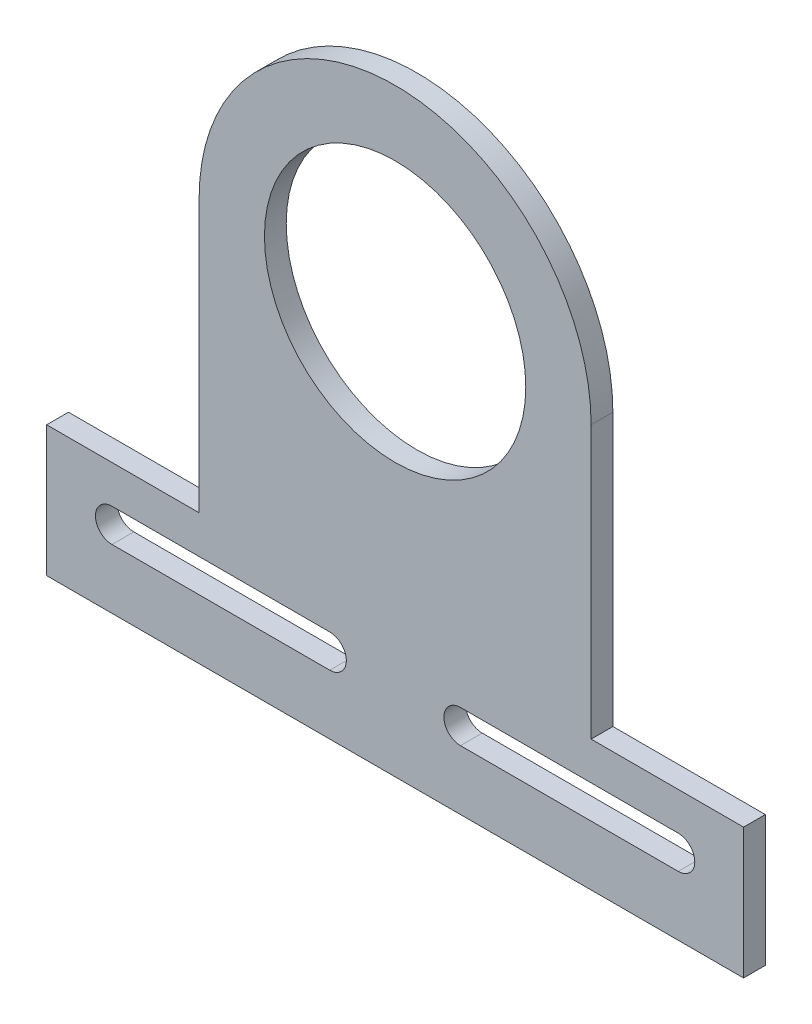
ISO-10303-21;
HEADER;
FILE_DESCRIPTION(('STEP AP214'),'2;1');
FILE_NAME('part.step','',(''),(''),'','','');
FILE_SCHEMA(('AUTOMOTIVE_DESIGN { 1 0 10303 214 1 1 1 1 }'));
ENDSEC;
DATA;
#1=APPLICATION_CONTEXT('core data for automotive mechanical design processes');
#2=APPLICATION_PROTOCOL_DEFINITION('international standard','automotive_design',2000,#1);
#3=PRODUCT_CONTEXT('',#1,'mechanical');
#4=PRODUCT('Part','Part','',(#3));
#5=PRODUCT_RELATED_PRODUCT_CATEGORY('part','',(#4));
#6=PRODUCT_DEFINITION_FORMATION('','',#4);
#7=PRODUCT_DEFINITION_CONTEXT('part definition',#1,'design');
#8=PRODUCT_DEFINITION('design','',#6,#7);
#9=PRODUCT_DEFINITION_SHAPE('','',#8);
#10=(LENGTH_UNIT() NAMED_UNIT(*) SI_UNIT(.MILLI.,.METRE.));
#11=(NAMED_UNIT(*) PLANE_ANGLE_UNIT() SI_UNIT($,.RADIAN.));
#12=(NAMED_UNIT(*) SI_UNIT($,.STERADIAN.) SOLID_ANGLE_UNIT());
#13=UNCERTAINTY_MEASURE_WITH_UNIT(LENGTH_MEASURE(1.E-05),#10,'distance_accuracy_value','');
#14=(GEOMETRIC_REPRESENTATION_CONTEXT(3) GLOBAL_UNCERTAINTY_ASSIGNED_CONTEXT((#13)) GLOBAL_UNIT_ASSIGNED_CONTEXT((#10,
#11,#12)) REPRESENTATION_CONTEXT('',''));
#15=CARTESIAN_POINT('',(0.,0.,0.));
#16=DIRECTION('',(0.,0.,1.));
#17=DIRECTION('',(1.,0.,0.));
#18=AXIS2_PLACEMENT_3D('',#15,#16,#17);
#19=CARTESIAN_POINT('',(0.,0.,6.35));
#20=DIRECTION('',(0.,0.,-1.));
#21=DIRECTION('',(-1.,0.,0.));
#22=AXIS2_PLACEMENT_3D('',#19,#20,#21);
#23=PLANE('',#22);
#24=CARTESIAN_POINT('',(0.,0.,6.35));
#25=DIRECTION('',(0.,0.,1.));
#26=DIRECTION('',(-1.,0.,0.));
#27=AXIS2_PLACEMENT_3D('',#24,#25,#26);
#28=CIRCLE('',#27,57.15);
#29=CARTESIAN_POINT('',(57.15,0.,6.35));
#30=VERTEX_POINT('',#29);
#31=CARTESIAN_POINT('',(-57.15,0.,6.35));
#32=VERTEX_POINT('',#31);
#33=EDGE_CURVE('E243',#30,#32,#28,.T.);
#34=ORIENTED_EDGE('',*,*,#33,.T.);
#35=DIRECTION('',(0.,-1.,0.));
#36=VECTOR('',#35,1.);
#37=CARTESIAN_POINT('',(-57.15,-79.375,6.35));
#38=LINE('',#37,#36);
#39=CARTESIAN_POINT('',(-57.15,-79.375,6.35));
#40=VERTEX_POINT('',#39);
#41=EDGE_CURVE('E246',#32,#40,#38,.T.);
#42=ORIENTED_EDGE('',*,*,#41,.T.);
#43=DIRECTION('',(-1.,0.,0.));
#44=VECTOR('',#43,1.);
#45=CARTESIAN_POINT('',(-101.6,-79.375,6.35));
#46=LINE('',#45,#44);
#47=CARTESIAN_POINT('',(-101.6,-79.375,6.35));
#48=VERTEX_POINT('',#47);
#49=EDGE_CURVE('E248',#40,#48,#46,.T.);
#50=ORIENTED_EDGE('',*,*,#49,.T.);
#51=DIRECTION('',(0.,-1.,0.));
#52=VECTOR('',#51,1.);
#53=CARTESIAN_POINT('',(-101.6,-117.475,6.35));
#54=LINE('',#53,#52);
#55=CARTESIAN_POINT('',(-101.6,-117.475,6.35));
#56=VERTEX_POINT('',#55);
#57=EDGE_CURVE('E250',#48,#56,#54,.T.);
#58=ORIENTED_EDGE('',*,*,#57,.T.);
#59=DIRECTION('',(1.,0.,0.));
#60=VECTOR('',#59,1.);
#61=CARTESIAN_POINT('',(101.6,-117.475,6.35));
#62=LINE('',#61,#60);
#63=CARTESIAN_POINT('',(101.6,-117.475,6.35));
#64=VERTEX_POINT('',#63);
#65=EDGE_CURVE('E252',#56,#64,#62,.T.);
#66=ORIENTED_EDGE('',*,*,#65,.T.);
#67=DIRECTION('',(0.,1.,0.));
#68=VECTOR('',#67,1.);
#69=CARTESIAN_POINT('',(101.6,-79.375,6.35));
#70=LINE('',#69,#68);
#71=CARTESIAN_POINT('',(101.6,-79.375,6.35));
#72=VERTEX_POINT('',#71);
#73=EDGE_CURVE('E254',#64,#72,#70,.T.);
#74=ORIENTED_EDGE('',*,*,#73,.T.);
#75=DIRECTION('',(-1.,0.,0.));
#76=VECTOR('',#75,1.);
#77=CARTESIAN_POINT('',(57.15,-79.375,6.35));
#78=LINE('',#77,#76);
#79=CARTESIAN_POINT('',(57.15,-79.375,6.35));
#80=VERTEX_POINT('',#79);
#81=EDGE_CURVE('E256',#72,#80,#78,.T.);
#82=ORIENTED_EDGE('',*,*,#81,.T.);
#83=DIRECTION('',(0.,1.,0.));
#84=VECTOR('',#83,1.);
#85=CARTESIAN_POINT('',(57.15,0.,6.35));
#86=LINE('',#85,#84);
#87=EDGE_CURVE('E258',#80,#30,#86,.T.);
#88=ORIENTED_EDGE('',*,*,#87,.T.);
#89=EDGE_LOOP('',(#34,#42,#50,#58,#66,#74,#82,#88));
#90=FACE_BOUND('',#89,.T.);
#91=CARTESIAN_POINT('',(0.,0.,6.35));
#92=DIRECTION('',(0.,0.,1.));
#93=DIRECTION('',(1.,0.,0.));
#94=AXIS2_PLACEMENT_3D('',#91,#92,#93);
#95=CIRCLE('',#94,38.1);
#96=CARTESIAN_POINT('',(38.1,0.,6.35));
#97=VERTEX_POINT('',#96);
#98=EDGE_CURVE('E214',#97,#97,#95,.T.);
#99=ORIENTED_EDGE('',*,*,#98,.F.);
#100=EDGE_LOOP('',(#99));
#101=FACE_BOUND('',#100,.T.);
#102=DIRECTION('',(1.,0.,0.));
#103=VECTOR('',#102,1.);
#104=CARTESIAN_POINT('',(-82.55,-100.076,6.35));
#105=LINE('',#104,#103);
#106=CARTESIAN_POINT('',(-82.55,-100.076,6.35));
#107=VERTEX_POINT('',#106);
#108=CARTESIAN_POINT('',(-19.05,-100.076,6.35));
#109=VERTEX_POINT('',#108);
#110=EDGE_CURVE('E190',#107,#109,#105,.T.);
#111=ORIENTED_EDGE('',*,*,#110,.F.);
#112=CARTESIAN_POINT('',(-82.55,-95.25,6.35));
#113=DIRECTION('',(0.,0.,1.));
#114=DIRECTION('',(1.,0.,0.));
#115=AXIS2_PLACEMENT_3D('',#112,#113,#114);
#116=CIRCLE('',#115,4.826);
#117=CARTESIAN_POINT('',(-82.55,-90.424,6.35));
#118=VERTEX_POINT('',#117);
#119=EDGE_CURVE('E186',#118,#107,#116,.T.);
#120=ORIENTED_EDGE('',*,*,#119,.F.);
#121=DIRECTION('',(-1.,0.,0.));
#122=VECTOR('',#121,1.);
#123=CARTESIAN_POINT('',(-19.05,-90.424,6.35));
#124=LINE('',#123,#122);
#125=CARTESIAN_POINT('',(-19.05,-90.424,6.35));
#126=VERTEX_POINT('',#125);
#127=EDGE_CURVE('E196',#126,#118,#124,.T.);
#128=ORIENTED_EDGE('',*,*,#127,.F.);
#129=CARTESIAN_POINT('',(-19.05,-95.25,6.35));
#130=DIRECTION('',(0.,0.,1.));
#131=DIRECTION('',(1.,0.,0.));
#132=AXIS2_PLACEMENT_3D('',#129,#130,#131);
#133=CIRCLE('',#132,4.826);
#134=EDGE_CURVE('E193',#109,#126,#133,.T.);
#135=ORIENTED_EDGE('',*,*,#134,.F.);
#136=EDGE_LOOP('',(#111,#120,#128,#135));
#137=FACE_BOUND('',#136,.T.);
#138=CARTESIAN_POINT('',(82.55,-95.25,6.35));
#139=DIRECTION('',(0.,0.,-1.));
#140=DIRECTION('',(-1.,0.,0.));
#141=AXIS2_PLACEMENT_3D('',#138,#139,#140);
#142=CIRCLE('',#141,4.826);
#143=CARTESIAN_POINT('',(82.55,-90.424,6.35));
#144=VERTEX_POINT('',#143);
#145=CARTESIAN_POINT('',(82.55,-100.076,6.35));
#146=VERTEX_POINT('',#145);
#147=EDGE_CURVE('E57',#144,#146,#142,.T.);
#148=ORIENTED_EDGE('',*,*,#147,.T.);
#149=DIRECTION('',(-1.,0.,0.));
#150=VECTOR('',#149,1.);
#151=CARTESIAN_POINT('',(82.55,-100.076,6.35));
#152=LINE('',#151,#150);
#153=CARTESIAN_POINT('',(19.05,-100.076,6.35));
#154=VERTEX_POINT('',#153);
#155=EDGE_CURVE('E172',#146,#154,#152,.T.);
#156=ORIENTED_EDGE('',*,*,#155,.T.);
#157=CARTESIAN_POINT('',(19.05,-95.25,6.35));
#158=DIRECTION('',(0.,0.,-1.));
#159=DIRECTION('',(-1.,0.,0.));
#160=AXIS2_PLACEMENT_3D('',#157,#158,#159);
#161=CIRCLE('',#160,4.826);
#162=CARTESIAN_POINT('',(19.05,-90.424,6.35));
#163=VERTEX_POINT('',#162);
#164=EDGE_CURVE('E159',#154,#163,#161,.T.);
#165=ORIENTED_EDGE('',*,*,#164,.T.);
#166=DIRECTION('',(1.,0.,0.));
#167=VECTOR('',#166,1.);
#168=CARTESIAN_POINT('',(19.05,-90.424,6.35));
#169=LINE('',#168,#167);
#170=EDGE_CURVE('E168',#163,#144,#169,.T.);
#171=ORIENTED_EDGE('',*,*,#170,.T.);
#172=EDGE_LOOP('',(#148,#156,#165,#171));
#173=FACE_BOUND('',#172,.T.);
#174=ADVANCED_FACE('F42',(#90,#101,#137,#173),#23,.F.);
#175=CARTESIAN_POINT('',(0.,0.,0.));
#176=DIRECTION('',(0.,0.,-1.));
#177=DIRECTION('',(-1.,0.,0.));
#178=AXIS2_PLACEMENT_3D('',#175,#176,#177);
#179=PLANE('',#178);
#180=CARTESIAN_POINT('',(0.,0.,0.));
#181=DIRECTION('',(0.,0.,1.));
#182=DIRECTION('',(-1.,0.,0.));
#183=AXIS2_PLACEMENT_3D('',#180,#181,#182);
#184=CIRCLE('',#183,57.15);
#185=CARTESIAN_POINT('',(57.15,0.,0.));
#186=VERTEX_POINT('',#185);
#187=CARTESIAN_POINT('',(-57.15,0.,0.));
#188=VERTEX_POINT('',#187);
#189=EDGE_CURVE('E226',#186,#188,#184,.T.);
#190=ORIENTED_EDGE('',*,*,#189,.F.);
#191=DIRECTION('',(0.,1.,0.));
#192=VECTOR('',#191,1.);
#193=CARTESIAN_POINT('',(57.15,0.,0.));
#194=LINE('',#193,#192);
#195=CARTESIAN_POINT('',(57.15,-79.375,0.));
#196=VERTEX_POINT('',#195);
#197=EDGE_CURVE('E241',#196,#186,#194,.T.);
#198=ORIENTED_EDGE('',*,*,#197,.F.);
#199=DIRECTION('',(-1.,0.,0.));
#200=VECTOR('',#199,1.);
#201=CARTESIAN_POINT('',(57.15,-79.375,0.));
#202=LINE('',#201,#200);
#203=CARTESIAN_POINT('',(101.6,-79.375,0.));
#204=VERTEX_POINT('',#203);
#205=EDGE_CURVE('E239',#204,#196,#202,.T.);
#206=ORIENTED_EDGE('',*,*,#205,.F.);
#207=DIRECTION('',(0.,1.,0.));
#208=VECTOR('',#207,1.);
#209=CARTESIAN_POINT('',(101.6,-79.375,0.));
#210=LINE('',#209,#208);
#211=CARTESIAN_POINT('',(101.6,-117.475,0.));
#212=VERTEX_POINT('',#211);
#213=EDGE_CURVE('E237',#212,#204,#210,.T.);
#214=ORIENTED_EDGE('',*,*,#213,.F.);
#215=DIRECTION('',(1.,0.,0.));
#216=VECTOR('',#215,1.);
#217=CARTESIAN_POINT('',(101.6,-117.475,0.));
#218=LINE('',#217,#216);
#219=CARTESIAN_POINT('',(-101.6,-117.475,0.));
#220=VERTEX_POINT('',#219);
#221=EDGE_CURVE('E235',#220,#212,#218,.T.);
#222=ORIENTED_EDGE('',*,*,#221,.F.);
#223=DIRECTION('',(0.,-1.,0.));
#224=VECTOR('',#223,1.);
#225=CARTESIAN_POINT('',(-101.6,-117.475,0.));
#226=LINE('',#225,#224);
#227=CARTESIAN_POINT('',(-101.6,-79.375,0.));
#228=VERTEX_POINT('',#227);
#229=EDGE_CURVE('E233',#228,#220,#226,.T.);
#230=ORIENTED_EDGE('',*,*,#229,.F.);
#231=DIRECTION('',(-1.,0.,0.));
#232=VECTOR('',#231,1.);
#233=CARTESIAN_POINT('',(-101.6,-79.375,0.));
#234=LINE('',#233,#232);
#235=CARTESIAN_POINT('',(-57.15,-79.375,0.));
#236=VERTEX_POINT('',#235);
#237=EDGE_CURVE('E231',#236,#228,#234,.T.);
#238=ORIENTED_EDGE('',*,*,#237,.F.);
#239=DIRECTION('',(0.,-1.,0.));
#240=VECTOR('',#239,1.);
#241=CARTESIAN_POINT('',(-57.15,-79.375,0.));
#242=LINE('',#241,#240);
#243=EDGE_CURVE('E229',#188,#236,#242,.T.);
#244=ORIENTED_EDGE('',*,*,#243,.F.);
#245=EDGE_LOOP('',(#190,#198,#206,#214,#222,#230,#238,#244));
#246=FACE_BOUND('',#245,.T.);
#247=CARTESIAN_POINT('',(0.,0.,0.));
#248=DIRECTION('',(0.,0.,1.));
#249=DIRECTION('',(1.,0.,0.));
#250=AXIS2_PLACEMENT_3D('',#247,#248,#249);
#251=CIRCLE('',#250,38.1);
#252=CARTESIAN_POINT('',(38.1,0.,0.));
#253=VERTEX_POINT('',#252);
#254=EDGE_CURVE('E223',#253,#253,#251,.T.);
#255=ORIENTED_EDGE('',*,*,#254,.T.);
#256=EDGE_LOOP('',(#255));
#257=FACE_BOUND('',#256,.T.);
#258=CARTESIAN_POINT('',(-82.55,-95.25,0.));
#259=DIRECTION('',(0.,0.,1.));
#260=DIRECTION('',(1.,0.,0.));
#261=AXIS2_PLACEMENT_3D('',#258,#259,#260);
#262=CIRCLE('',#261,4.826);
#263=CARTESIAN_POINT('',(-82.55,-90.424,0.));
#264=VERTEX_POINT('',#263);
#265=CARTESIAN_POINT('',(-82.55,-100.076,0.));
#266=VERTEX_POINT('',#265);
#267=EDGE_CURVE('E199',#264,#266,#262,.T.);
#268=ORIENTED_EDGE('',*,*,#267,.T.);
#269=DIRECTION('',(1.,0.,0.));
#270=VECTOR('',#269,1.);
#271=CARTESIAN_POINT('',(-82.55,-100.076,0.));
#272=LINE('',#271,#270);
#273=CARTESIAN_POINT('',(-19.05,-100.076,0.));
#274=VERTEX_POINT('',#273);
#275=EDGE_CURVE('E202',#266,#274,#272,.T.);
#276=ORIENTED_EDGE('',*,*,#275,.T.);
#277=CARTESIAN_POINT('',(-19.05,-95.25,0.));
#278=DIRECTION('',(0.,0.,1.));
#279=DIRECTION('',(1.,0.,0.));
#280=AXIS2_PLACEMENT_3D('',#277,#278,#279);
#281=CIRCLE('',#280,4.826);
#282=CARTESIAN_POINT('',(-19.05,-90.424,0.));
#283=VERTEX_POINT('',#282);
#284=EDGE_CURVE('E205',#274,#283,#281,.T.);
#285=ORIENTED_EDGE('',*,*,#284,.T.);
#286=DIRECTION('',(-1.,0.,0.));
#287=VECTOR('',#286,1.);
#288=CARTESIAN_POINT('',(-19.05,-90.424,0.));
#289=LINE('',#288,#287);
#290=EDGE_CURVE('E208',#283,#264,#289,.T.);
#291=ORIENTED_EDGE('',*,*,#290,.T.);
#292=EDGE_LOOP('',(#268,#276,#285,#291));
#293=FACE_BOUND('',#292,.T.);
#294=DIRECTION('',(-1.,0.,0.));
#295=VECTOR('',#294,1.);
#296=CARTESIAN_POINT('',(82.55,-100.076,0.));
#297=LINE('',#296,#295);
#298=CARTESIAN_POINT('',(82.55,-100.076,0.));
#299=VERTEX_POINT('',#298);
#300=CARTESIAN_POINT('',(19.05,-100.076,0.));
#301=VERTEX_POINT('',#300);
#302=EDGE_CURVE('E182',#299,#301,#297,.T.);
#303=ORIENTED_EDGE('',*,*,#302,.F.);
#304=CARTESIAN_POINT('',(82.55,-95.25,0.));
#305=DIRECTION('',(0.,0.,-1.));
#306=DIRECTION('',(-1.,0.,0.));
#307=AXIS2_PLACEMENT_3D('',#304,#305,#306);
#308=CIRCLE('',#307,4.826);
#309=CARTESIAN_POINT('',(82.55,-90.424,0.));
#310=VERTEX_POINT('',#309);
#311=EDGE_CURVE('E174',#310,#299,#308,.T.);
#312=ORIENTED_EDGE('',*,*,#311,.F.);
#313=DIRECTION('',(1.,0.,0.));
#314=VECTOR('',#313,1.);
#315=CARTESIAN_POINT('',(19.05,-90.424,0.));
#316=LINE('',#315,#314);
#317=CARTESIAN_POINT('',(19.05,-90.424,0.));
#318=VERTEX_POINT('',#317);
#319=EDGE_CURVE('E179',#318,#310,#316,.T.);
#320=ORIENTED_EDGE('',*,*,#319,.F.);
#321=CARTESIAN_POINT('',(19.05,-95.25,0.));
#322=DIRECTION('',(0.,0.,-1.));
#323=DIRECTION('',(-1.,0.,0.));
#324=AXIS2_PLACEMENT_3D('',#321,#322,#323);
#325=CIRCLE('',#324,4.826);
#326=EDGE_CURVE('E162',#301,#318,#325,.T.);
#327=ORIENTED_EDGE('',*,*,#326,.F.);
#328=EDGE_LOOP('',(#303,#312,#320,#327));
#329=FACE_BOUND('',#328,.T.);
#330=ADVANCED_FACE('F288',(#246,#257,#293,#329),#179,.T.);
#331=CARTESIAN_POINT('',(0.,0.,6.35));
#332=DIRECTION('',(0.,0.,-1.));
#333=DIRECTION('',(-1.,0.,0.));
#334=AXIS2_PLACEMENT_3D('',#331,#332,#333);
#335=CYLINDRICAL_SURFACE('',#334,57.15);
#336=ORIENTED_EDGE('',*,*,#189,.T.);
#337=DIRECTION('',(0.,0.,-1.));
#338=VECTOR('',#337,1.);
#339=CARTESIAN_POINT('',(-57.15,0.,6.35));
#340=LINE('',#339,#338);
#341=EDGE_CURVE('E11',#32,#188,#340,.T.);
#342=ORIENTED_EDGE('',*,*,#341,.F.);
#343=ORIENTED_EDGE('',*,*,#33,.F.);
#344=DIRECTION('',(0.,0.,-1.));
#345=VECTOR('',#344,1.);
#346=CARTESIAN_POINT('',(57.15,0.,6.35));
#347=LINE('',#346,#345);
#348=EDGE_CURVE('E260',#30,#186,#347,.T.);
#349=ORIENTED_EDGE('',*,*,#348,.T.);
#350=EDGE_LOOP('',(#336,#342,#343,#349));
#351=FACE_BOUND('',#350,.T.);
#352=ADVANCED_FACE('F44',(#351),#335,.T.);
#353=CARTESIAN_POINT('',(-57.15,-79.375,6.35));
#354=DIRECTION('',(1.,0.,0.));
#355=DIRECTION('',(0.,0.,-1.));
#356=AXIS2_PLACEMENT_3D('',#353,#354,#355);
#357=PLANE('',#356);
#358=ORIENTED_EDGE('',*,*,#243,.T.);
#359=DIRECTION('',(0.,0.,-1.));
#360=VECTOR('',#359,1.);
#361=CARTESIAN_POINT('',(-57.15,-79.375,6.35));
#362=LINE('',#361,#360);
#363=EDGE_CURVE('E50',#40,#236,#362,.T.);
#364=ORIENTED_EDGE('',*,*,#363,.F.);
#365=ORIENTED_EDGE('',*,*,#41,.F.);
#366=ORIENTED_EDGE('',*,*,#341,.T.);
#367=EDGE_LOOP('',(#358,#364,#365,#366));
#368=FACE_BOUND('',#367,.T.);
#369=ADVANCED_FACE('F306',(#368),#357,.F.);
#370=CARTESIAN_POINT('',(-101.6,-79.375,6.35));
#371=DIRECTION('',(0.,-1.,0.));
#372=DIRECTION('',(0.,0.,-1.));
#373=AXIS2_PLACEMENT_3D('',#370,#371,#372);
#374=PLANE('',#373);
#375=ORIENTED_EDGE('',*,*,#237,.T.);
#376=DIRECTION('',(0.,0.,-1.));
#377=VECTOR('',#376,1.);
#378=CARTESIAN_POINT('',(-101.6,-79.375,6.35));
#379=LINE('',#378,#377);
#380=EDGE_CURVE('E275',#48,#228,#379,.T.);
#381=ORIENTED_EDGE('',*,*,#380,.F.);
#382=ORIENTED_EDGE('',*,*,#49,.F.);
#383=ORIENTED_EDGE('',*,*,#363,.T.);
#384=EDGE_LOOP('',(#375,#381,#382,#383));
#385=FACE_BOUND('',#384,.T.);
#386=ADVANCED_FACE('F282',(#385),#374,.F.);
#387=CARTESIAN_POINT('',(-101.6,-117.475,6.35));
#388=DIRECTION('',(1.,0.,0.));
#389=DIRECTION('',(0.,0.,-1.));
#390=AXIS2_PLACEMENT_3D('',#387,#388,#389);
#391=PLANE('',#390);
#392=ORIENTED_EDGE('',*,*,#229,.T.);
#393=DIRECTION('',(0.,0.,-1.));
#394=VECTOR('',#393,1.);
#395=CARTESIAN_POINT('',(-101.6,-117.475,6.35));
#396=LINE('',#395,#394);
#397=EDGE_CURVE('E272',#56,#220,#396,.T.);
#398=ORIENTED_EDGE('',*,*,#397,.F.);
#399=ORIENTED_EDGE('',*,*,#57,.F.);
#400=ORIENTED_EDGE('',*,*,#380,.T.);
#401=EDGE_LOOP('',(#392,#398,#399,#400));
#402=FACE_BOUND('',#401,.T.);
#403=ADVANCED_FACE('F294',(#402),#391,.F.);
#404=CARTESIAN_POINT('',(101.6,-117.475,6.35));
#405=DIRECTION('',(0.,1.,0.));
#406=DIRECTION('',(-1.,0.,0.));
#407=AXIS2_PLACEMENT_3D('',#404,#405,#406);
#408=PLANE('',#407);
#409=ORIENTED_EDGE('',*,*,#221,.T.);
#410=DIRECTION('',(0.,0.,-1.));
#411=VECTOR('',#410,1.);
#412=CARTESIAN_POINT('',(101.6,-117.475,6.35));
#413=LINE('',#412,#411);
#414=EDGE_CURVE('E269',#64,#212,#413,.T.);
#415=ORIENTED_EDGE('',*,*,#414,.F.);
#416=ORIENTED_EDGE('',*,*,#65,.F.);
#417=ORIENTED_EDGE('',*,*,#397,.T.);
#418=EDGE_LOOP('',(#409,#415,#416,#417));
#419=FACE_BOUND('',#418,.T.);
#420=ADVANCED_FACE('F298',(#419),#408,.F.);
#421=CARTESIAN_POINT('',(101.6,-79.375,6.35));
#422=DIRECTION('',(-1.,0.,0.));
#423=DIRECTION('',(0.,0.,1.));
#424=AXIS2_PLACEMENT_3D('',#421,#422,#423);
#425=PLANE('',#424);
#426=ORIENTED_EDGE('',*,*,#213,.T.);
#427=DIRECTION('',(0.,0.,-1.));
#428=VECTOR('',#427,1.);
#429=CARTESIAN_POINT('',(101.6,-79.375,6.35));
#430=LINE('',#429,#428);
#431=EDGE_CURVE('E266',#72,#204,#430,.T.);
#432=ORIENTED_EDGE('',*,*,#431,.F.);
#433=ORIENTED_EDGE('',*,*,#73,.F.);
#434=ORIENTED_EDGE('',*,*,#414,.T.);
#435=EDGE_LOOP('',(#426,#432,#433,#434));
#436=FACE_BOUND('',#435,.T.);
#437=ADVANCED_FACE('F319',(#436),#425,.F.);
#438=CARTESIAN_POINT('',(57.15,-79.375,6.35));
#439=DIRECTION('',(0.,-1.,0.));
#440=DIRECTION('',(0.,0.,-1.));
#441=AXIS2_PLACEMENT_3D('',#438,#439,#440);
#442=PLANE('',#441);
#443=ORIENTED_EDGE('',*,*,#205,.T.);
#444=DIRECTION('',(0.,0.,-1.));
#445=VECTOR('',#444,1.);
#446=CARTESIAN_POINT('',(57.15,-79.375,6.35));
#447=LINE('',#446,#445);
#448=EDGE_CURVE('E263',#80,#196,#447,.T.);
#449=ORIENTED_EDGE('',*,*,#448,.F.);
#450=ORIENTED_EDGE('',*,*,#81,.F.);
#451=ORIENTED_EDGE('',*,*,#431,.T.);
#452=EDGE_LOOP('',(#443,#449,#450,#451));
#453=FACE_BOUND('',#452,.T.);
#454=ADVANCED_FACE('F317',(#453),#442,.F.);
#455=CARTESIAN_POINT('',(57.15,0.,6.35));
#456=DIRECTION('',(-1.,0.,0.));
#457=DIRECTION('',(0.,-1.,0.));
#458=AXIS2_PLACEMENT_3D('',#455,#456,#457);
#459=PLANE('',#458);
#460=ORIENTED_EDGE('',*,*,#197,.T.);
#461=ORIENTED_EDGE('',*,*,#348,.F.);
#462=ORIENTED_EDGE('',*,*,#87,.F.);
#463=ORIENTED_EDGE('',*,*,#448,.T.);
#464=EDGE_LOOP('',(#460,#461,#462,#463));
#465=FACE_BOUND('',#464,.T.);
#466=ADVANCED_FACE('F312',(#465),#459,.F.);
#467=CARTESIAN_POINT('',(0.,0.,0.));
#468=DIRECTION('',(0.,0.,1.));
#469=DIRECTION('',(1.,0.,0.));
#470=AXIS2_PLACEMENT_3D('',#467,#468,#469);
#471=CYLINDRICAL_SURFACE('',#470,38.1);
#472=ORIENTED_EDGE('',*,*,#254,.F.);
#473=EDGE_LOOP('',(#472));
#474=FACE_BOUND('',#473,.T.);
#475=ORIENTED_EDGE('',*,*,#98,.T.);
#476=EDGE_LOOP('',(#475));
#477=FACE_BOUND('',#476,.T.);
#478=ADVANCED_FACE('F337',(#474,#477),#471,.F.);
#479=CARTESIAN_POINT('',(-82.55,-95.25,0.));
#480=DIRECTION('',(0.,0.,1.));
#481=DIRECTION('',(1.,0.,0.));
#482=AXIS2_PLACEMENT_3D('',#479,#480,#481);
#483=CYLINDRICAL_SURFACE('',#482,4.826);
#484=ORIENTED_EDGE('',*,*,#119,.T.);
#485=DIRECTION('',(0.,0.,1.));
#486=VECTOR('',#485,1.);
#487=CARTESIAN_POINT('',(-82.55,-100.076,0.));
#488=LINE('',#487,#486);
#489=EDGE_CURVE('E211',#266,#107,#488,.T.);
#490=ORIENTED_EDGE('',*,*,#489,.F.);
#491=ORIENTED_EDGE('',*,*,#267,.F.);
#492=DIRECTION('',(0.,0.,1.));
#493=VECTOR('',#492,1.);
#494=CARTESIAN_POINT('',(-82.55,-90.424,0.));
#495=LINE('',#494,#493);
#496=EDGE_CURVE('E212',#264,#118,#495,.T.);
#497=ORIENTED_EDGE('',*,*,#496,.T.);
#498=EDGE_LOOP('',(#484,#490,#491,#497));
#499=FACE_BOUND('',#498,.T.);
#500=ADVANCED_FACE('F341',(#499),#483,.F.);
#501=CARTESIAN_POINT('',(-19.05,-90.424,0.));
#502=DIRECTION('',(0.,1.,0.));
#503=DIRECTION('',(-1.,0.,0.));
#504=AXIS2_PLACEMENT_3D('',#501,#502,#503);
#505=PLANE('',#504);
#506=ORIENTED_EDGE('',*,*,#127,.T.);
#507=ORIENTED_EDGE('',*,*,#496,.F.);
#508=ORIENTED_EDGE('',*,*,#290,.F.);
#509=DIRECTION('',(0.,0.,1.));
#510=VECTOR('',#509,1.);
#511=CARTESIAN_POINT('',(-19.05,-90.424,0.));
#512=LINE('',#511,#510);
#513=EDGE_CURVE('E215',#283,#126,#512,.T.);
#514=ORIENTED_EDGE('',*,*,#513,.T.);
#515=EDGE_LOOP('',(#506,#507,#508,#514));
#516=FACE_BOUND('',#515,.T.);
#517=ADVANCED_FACE('F346',(#516),#505,.F.);
#518=CARTESIAN_POINT('',(-19.05,-95.25,0.));
#519=DIRECTION('',(0.,0.,1.));
#520=DIRECTION('',(1.,0.,0.));
#521=AXIS2_PLACEMENT_3D('',#518,#519,#520);
#522=CYLINDRICAL_SURFACE('',#521,4.826);
#523=ORIENTED_EDGE('',*,*,#134,.T.);
#524=ORIENTED_EDGE('',*,*,#513,.F.);
#525=ORIENTED_EDGE('',*,*,#284,.F.);
#526=DIRECTION('',(0.,0.,1.));
#527=VECTOR('',#526,1.);
#528=CARTESIAN_POINT('',(-19.05,-100.076,0.));
#529=LINE('',#528,#527);
#530=EDGE_CURVE('E217',#274,#109,#529,.T.);
#531=ORIENTED_EDGE('',*,*,#530,.T.);
#532=EDGE_LOOP('',(#523,#524,#525,#531));
#533=FACE_BOUND('',#532,.T.);
#534=ADVANCED_FACE('F356',(#533),#522,.F.);
#535=CARTESIAN_POINT('',(-82.55,-100.076,0.));
#536=DIRECTION('',(0.,-1.,0.));
#537=DIRECTION('',(0.,0.,-1.));
#538=AXIS2_PLACEMENT_3D('',#535,#536,#537);
#539=PLANE('',#538);
#540=ORIENTED_EDGE('',*,*,#110,.T.);
#541=ORIENTED_EDGE('',*,*,#530,.F.);
#542=ORIENTED_EDGE('',*,*,#275,.F.);
#543=ORIENTED_EDGE('',*,*,#489,.T.);
#544=EDGE_LOOP('',(#540,#541,#542,#543));
#545=FACE_BOUND('',#544,.T.);
#546=ADVANCED_FACE('F352',(#545),#539,.F.);
#547=CARTESIAN_POINT('',(82.55,-95.25,0.));
#548=DIRECTION('',(0.,0.,1.));
#549=DIRECTION('',(1.,0.,0.));
#550=AXIS2_PLACEMENT_3D('',#547,#548,#549);
#551=CYLINDRICAL_SURFACE('',#550,4.826);
#552=ORIENTED_EDGE('',*,*,#147,.F.);
#553=DIRECTION('',(0.,0.,1.));
#554=VECTOR('',#553,1.);
#555=CARTESIAN_POINT('',(82.55,-90.424,0.));
#556=LINE('',#555,#554);
#557=EDGE_CURVE('E165',#310,#144,#556,.T.);
#558=ORIENTED_EDGE('',*,*,#557,.F.);
#559=ORIENTED_EDGE('',*,*,#311,.T.);
#560=DIRECTION('',(0.,0.,1.));
#561=VECTOR('',#560,1.);
#562=CARTESIAN_POINT('',(82.55,-100.076,0.));
#563=LINE('',#562,#561);
#564=EDGE_CURVE('E184',#299,#146,#563,.T.);
#565=ORIENTED_EDGE('',*,*,#564,.T.);
#566=EDGE_LOOP('',(#552,#558,#559,#565));
#567=FACE_BOUND('',#566,.T.);
#568=ADVANCED_FACE('F355',(#567),#551,.F.);
#569=CARTESIAN_POINT('',(82.55,-100.076,0.));
#570=DIRECTION('',(0.,1.,0.));
#571=DIRECTION('',(0.,0.,1.));
#572=AXIS2_PLACEMENT_3D('',#569,#570,#571);
#573=PLANE('',#572);
#574=ORIENTED_EDGE('',*,*,#155,.F.);
#575=ORIENTED_EDGE('',*,*,#564,.F.);
#576=ORIENTED_EDGE('',*,*,#302,.T.);
#577=DIRECTION('',(0.,0.,1.));
#578=VECTOR('',#577,1.);
#579=CARTESIAN_POINT('',(19.05,-100.076,0.));
#580=LINE('',#579,#578);
#581=EDGE_CURVE('E164',#301,#154,#580,.T.);
#582=ORIENTED_EDGE('',*,*,#581,.T.);
#583=EDGE_LOOP('',(#574,#575,#576,#582));
#584=FACE_BOUND('',#583,.T.);
#585=ADVANCED_FACE('F366',(#584),#573,.T.);
#586=CARTESIAN_POINT('',(19.05,-95.25,0.));
#587=DIRECTION('',(0.,0.,1.));
#588=DIRECTION('',(1.,0.,0.));
#589=AXIS2_PLACEMENT_3D('',#586,#587,#588);
#590=CYLINDRICAL_SURFACE('',#589,4.826);
#591=ORIENTED_EDGE('',*,*,#164,.F.);
#592=ORIENTED_EDGE('',*,*,#581,.F.);
#593=ORIENTED_EDGE('',*,*,#326,.T.);
#594=DIRECTION('',(0.,0.,1.));
#595=VECTOR('',#594,1.);
#596=CARTESIAN_POINT('',(19.05,-90.424,0.));
#597=LINE('',#596,#595);
#598=EDGE_CURVE('E65',#318,#163,#597,.T.);
#599=ORIENTED_EDGE('',*,*,#598,.T.);
#600=EDGE_LOOP('',(#591,#592,#593,#599));
#601=FACE_BOUND('',#600,.T.);
#602=ADVANCED_FACE('F156',(#601),#590,.F.);
#603=CARTESIAN_POINT('',(19.05,-90.424,0.));
#604=DIRECTION('',(0.,-1.,0.));
#605=DIRECTION('',(1.,0.,0.));
#606=AXIS2_PLACEMENT_3D('',#603,#604,#605);
#607=PLANE('',#606);
#608=ORIENTED_EDGE('',*,*,#170,.F.);
#609=ORIENTED_EDGE('',*,*,#598,.F.);
#610=ORIENTED_EDGE('',*,*,#319,.T.);
#611=ORIENTED_EDGE('',*,*,#557,.T.);
#612=EDGE_LOOP('',(#608,#609,#610,#611));
#613=FACE_BOUND('',#612,.T.);
#614=ADVANCED_FACE('F169',(#613),#607,.T.);
#615=CLOSED_SHELL('',(#174,#330,#352,#369,#386,#403,#420,#437,#454,#466,#478,#500,#517,#534,
#546,#568,#585,#602,#614));
#616=MANIFOLD_SOLID_BREP('B2',#615);
#617=ADVANCED_BREP_SHAPE_REPRESENTATION('',(#18,#616),#14);
#618=SHAPE_DEFINITION_REPRESENTATION(#9,#617);
ENDSEC;
END-ISO-10303-21;
